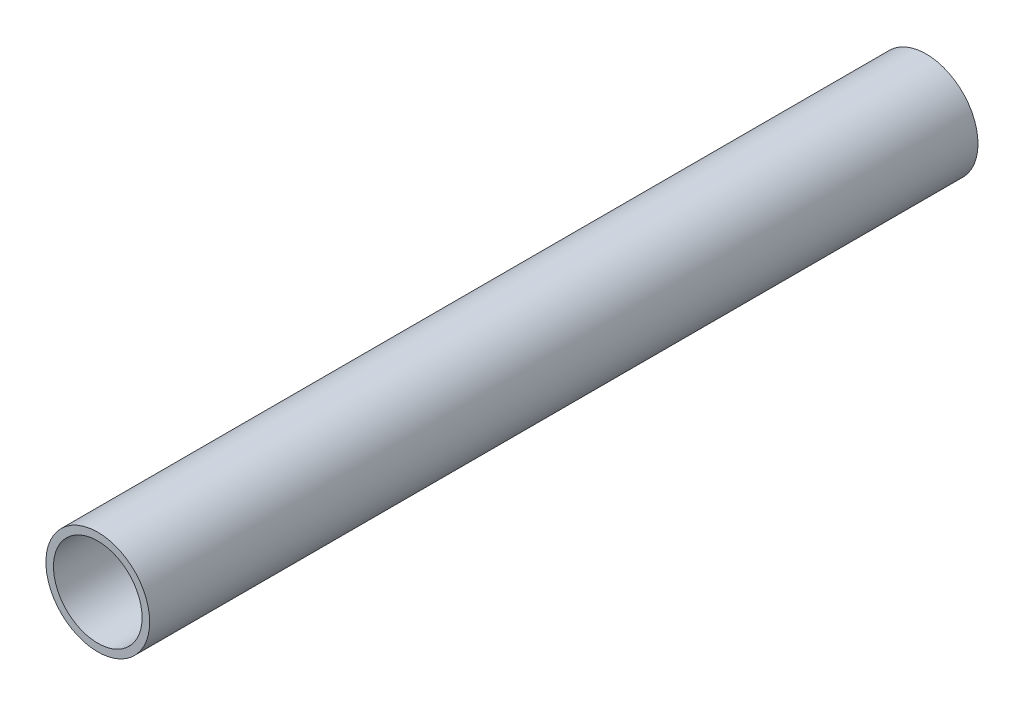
ISO-10303-21;
HEADER;
FILE_DESCRIPTION(('STEP AP214'),'2;1');
FILE_NAME('part.step','',(''),(''),'','','');
FILE_SCHEMA(('AUTOMOTIVE_DESIGN { 1 0 10303 214 1 1 1 1 }'));
ENDSEC;
DATA;
#1=APPLICATION_CONTEXT('core data for automotive mechanical design processes');
#2=APPLICATION_PROTOCOL_DEFINITION('international standard','automotive_design',2000,#1);
#3=PRODUCT_CONTEXT('',#1,'mechanical');
#4=PRODUCT('Part','Part','',(#3));
#5=PRODUCT_RELATED_PRODUCT_CATEGORY('part','',(#4));
#6=PRODUCT_DEFINITION_FORMATION('','',#4);
#7=PRODUCT_DEFINITION_CONTEXT('part definition',#1,'design');
#8=PRODUCT_DEFINITION('design','',#6,#7);
#9=PRODUCT_DEFINITION_SHAPE('','',#8);
#10=(LENGTH_UNIT() NAMED_UNIT(*) SI_UNIT(.MILLI.,.METRE.));
#11=(NAMED_UNIT(*) PLANE_ANGLE_UNIT() SI_UNIT($,.RADIAN.));
#12=(NAMED_UNIT(*) SI_UNIT($,.STERADIAN.) SOLID_ANGLE_UNIT());
#13=UNCERTAINTY_MEASURE_WITH_UNIT(LENGTH_MEASURE(1.E-05),#10,'distance_accuracy_value','');
#14=(GEOMETRIC_REPRESENTATION_CONTEXT(3) GLOBAL_UNCERTAINTY_ASSIGNED_CONTEXT((#13)) GLOBAL_UNIT_ASSIGNED_CONTEXT((#10,
#11,#12)) REPRESENTATION_CONTEXT('',''));
#15=CARTESIAN_POINT('',(0.,0.,0.));
#16=DIRECTION('',(0.,0.,1.));
#17=DIRECTION('',(1.,0.,0.));
#18=AXIS2_PLACEMENT_3D('',#15,#16,#17);
#19=CARTESIAN_POINT('',(0.,0.,1474.47));
#20=DIRECTION('',(0.,0.,-1.));
#21=DIRECTION('',(-1.,0.,0.));
#22=AXIS2_PLACEMENT_3D('',#19,#20,#21);
#23=CYLINDRICAL_SURFACE('',#22,19.0881);
#24=CARTESIAN_POINT('',(0.,0.,304.8));
#25=DIRECTION('',(0.,0.,1.));
#26=DIRECTION('',(1.,0.,0.));
#27=AXIS2_PLACEMENT_3D('',#24,#25,#26);
#28=CIRCLE('',#27,19.0881);
#29=CARTESIAN_POINT('',(19.0881,0.,304.8));
#30=VERTEX_POINT('',#29);
#31=EDGE_CURVE('E51',#30,#30,#28,.T.);
#32=ORIENTED_EDGE('',*,*,#31,.T.);
#33=EDGE_LOOP('',(#32));
#34=FACE_BOUND('',#33,.T.);
#35=CARTESIAN_POINT('',(0.,0.,609.6));
#36=DIRECTION('',(0.,0.,1.));
#37=DIRECTION('',(1.,0.,0.));
#38=AXIS2_PLACEMENT_3D('',#35,#36,#37);
#39=CIRCLE('',#38,19.0881);
#40=CARTESIAN_POINT('',(19.0881,0.,609.6));
#41=VERTEX_POINT('',#40);
#42=EDGE_CURVE('E10',#41,#41,#39,.T.);
#43=ORIENTED_EDGE('',*,*,#42,.F.);
#44=EDGE_LOOP('',(#43));
#45=FACE_BOUND('',#44,.T.);
#46=ADVANCED_FACE('F39',(#34,#45),#23,.T.);
#47=CARTESIAN_POINT('',(0.,0.,0.));
#48=DIRECTION('',(0.,0.,1.));
#49=DIRECTION('',(1.,0.,0.));
#50=AXIS2_PLACEMENT_3D('',#47,#48,#49);
#51=CYLINDRICAL_SURFACE('',#50,16.3016415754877);
#52=CARTESIAN_POINT('',(0.,0.,304.8));
#53=DIRECTION('',(0.,0.,1.));
#54=DIRECTION('',(1.,0.,0.));
#55=AXIS2_PLACEMENT_3D('',#52,#53,#54);
#56=CIRCLE('',#55,16.3016415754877);
#57=CARTESIAN_POINT('',(16.3016415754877,0.,304.8));
#58=VERTEX_POINT('',#57);
#59=EDGE_CURVE('E42',#58,#58,#56,.F.);
#60=ORIENTED_EDGE('',*,*,#59,.T.);
#61=EDGE_LOOP('',(#60));
#62=FACE_BOUND('',#61,.T.);
#63=CARTESIAN_POINT('',(0.,0.,609.6));
#64=DIRECTION('',(0.,0.,1.));
#65=DIRECTION('',(1.,0.,0.));
#66=AXIS2_PLACEMENT_3D('',#63,#64,#65);
#67=CIRCLE('',#66,16.3016415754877);
#68=CARTESIAN_POINT('',(16.3016415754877,0.,609.6));
#69=VERTEX_POINT('',#68);
#70=EDGE_CURVE('E46',#69,#69,#67,.F.);
#71=ORIENTED_EDGE('',*,*,#70,.F.);
#72=EDGE_LOOP('',(#71));
#73=FACE_BOUND('',#72,.T.);
#74=ADVANCED_FACE('F59',(#62,#73),#51,.F.);
#75=CARTESIAN_POINT('',(0.,0.,609.6));
#76=DIRECTION('',(0.,0.,1.));
#77=DIRECTION('',(1.,0.,0.));
#78=AXIS2_PLACEMENT_3D('',#75,#76,#77);
#79=PLANE('',#78);
#80=ORIENTED_EDGE('',*,*,#70,.T.);
#81=EDGE_LOOP('',(#80));
#82=FACE_BOUND('',#81,.T.);
#83=ORIENTED_EDGE('',*,*,#42,.T.);
#84=EDGE_LOOP('',(#83));
#85=FACE_BOUND('',#84,.T.);
#86=ADVANCED_FACE('F65',(#82,#85),#79,.T.);
#87=CARTESIAN_POINT('',(0.,0.,304.8));
#88=DIRECTION('',(0.,0.,1.));
#89=DIRECTION('',(1.,0.,0.));
#90=AXIS2_PLACEMENT_3D('',#87,#88,#89);
#91=PLANE('',#90);
#92=ORIENTED_EDGE('',*,*,#59,.F.);
#93=EDGE_LOOP('',(#92));
#94=FACE_BOUND('',#93,.T.);
#95=ORIENTED_EDGE('',*,*,#31,.F.);
#96=EDGE_LOOP('',(#95));
#97=FACE_BOUND('',#96,.T.);
#98=ADVANCED_FACE('F62',(#94,#97),#91,.F.);
#99=CLOSED_SHELL('',(#46,#74,#86,#98));
#100=MANIFOLD_SOLID_BREP('B2',#99);
#101=ADVANCED_BREP_SHAPE_REPRESENTATION('',(#18,#100),#14);
#102=SHAPE_DEFINITION_REPRESENTATION(#9,#101);
ENDSEC;
END-ISO-10303-21;
